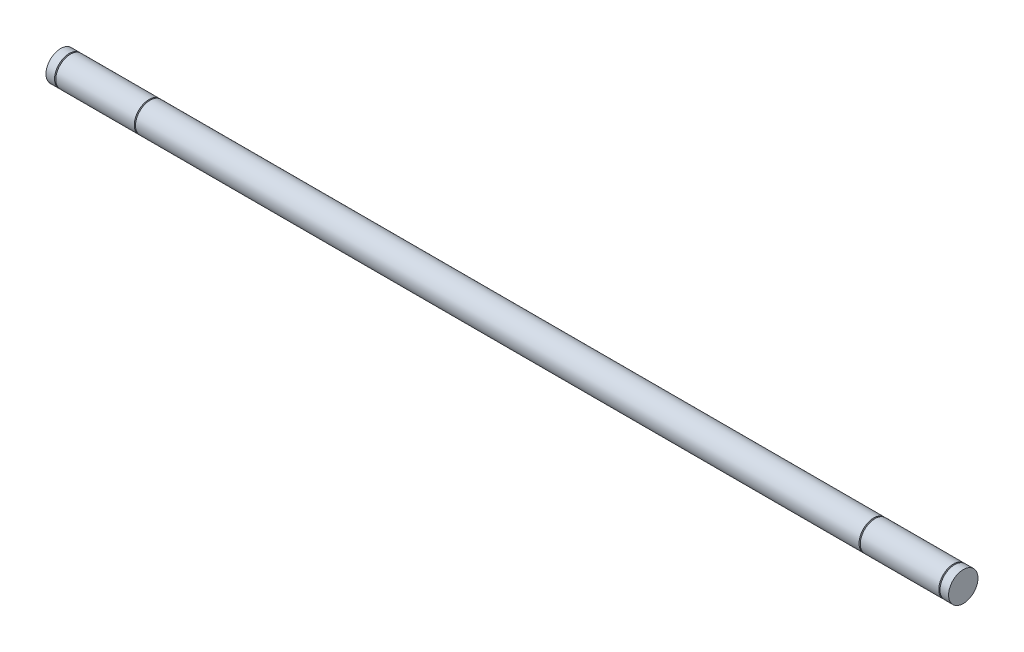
ISO-10303-21;
HEADER;
FILE_DESCRIPTION(('STEP AP214'),'2;1');
FILE_NAME('part.step','',(''),(''),'','','');
FILE_SCHEMA(('AUTOMOTIVE_DESIGN { 1 0 10303 214 1 1 1 1 }'));
ENDSEC;
DATA;
#1=APPLICATION_CONTEXT('core data for automotive mechanical design processes');
#2=APPLICATION_PROTOCOL_DEFINITION('international standard','automotive_design',2000,#1);
#3=PRODUCT_CONTEXT('',#1,'mechanical');
#4=PRODUCT('Part','Part','',(#3));
#5=PRODUCT_RELATED_PRODUCT_CATEGORY('part','',(#4));
#6=PRODUCT_DEFINITION_FORMATION('','',#4);
#7=PRODUCT_DEFINITION_CONTEXT('part definition',#1,'design');
#8=PRODUCT_DEFINITION('design','',#6,#7);
#9=PRODUCT_DEFINITION_SHAPE('','',#8);
#10=(LENGTH_UNIT() NAMED_UNIT(*) SI_UNIT(.MILLI.,.METRE.));
#11=(NAMED_UNIT(*) PLANE_ANGLE_UNIT() SI_UNIT($,.RADIAN.));
#12=(NAMED_UNIT(*) SI_UNIT($,.STERADIAN.) SOLID_ANGLE_UNIT());
#13=UNCERTAINTY_MEASURE_WITH_UNIT(LENGTH_MEASURE(1.E-05),#10,'distance_accuracy_value','');
#14=(GEOMETRIC_REPRESENTATION_CONTEXT(3) GLOBAL_UNCERTAINTY_ASSIGNED_CONTEXT((#13)) GLOBAL_UNIT_ASSIGNED_CONTEXT((#10,
#11,#12)) REPRESENTATION_CONTEXT('',''));
#15=CARTESIAN_POINT('',(0.,0.,0.));
#16=DIRECTION('',(0.,0.,1.));
#17=DIRECTION('',(1.,0.,0.));
#18=AXIS2_PLACEMENT_3D('',#15,#16,#17);
#19=CARTESIAN_POINT('',(292.1,0.,0.));
#20=DIRECTION('',(-1.,0.,0.));
#21=DIRECTION('',(0.,0.,1.));
#22=AXIS2_PLACEMENT_3D('',#19,#20,#21);
#23=CYLINDRICAL_SURFACE('',#22,9.525);
#24=CARTESIAN_POINT('',(-234.15625,0.,0.));
#25=DIRECTION('',(1.,0.,0.));
#26=DIRECTION('',(0.,0.,-1.));
#27=AXIS2_PLACEMENT_3D('',#24,#25,#26);
#28=CIRCLE('',#27,9.525);
#29=CARTESIAN_POINT('',(-234.15625,0.,-9.525));
#30=VERTEX_POINT('',#29);
#31=EDGE_CURVE('E94',#30,#30,#28,.T.);
#32=ORIENTED_EDGE('',*,*,#31,.T.);
#33=EDGE_LOOP('',(#32));
#34=FACE_BOUND('',#33,.T.);
#35=CARTESIAN_POINT('',(234.15625,0.,0.));
#36=DIRECTION('',(1.,0.,0.));
#37=DIRECTION('',(0.,0.,-1.));
#38=AXIS2_PLACEMENT_3D('',#35,#36,#37);
#39=CIRCLE('',#38,9.525);
#40=CARTESIAN_POINT('',(234.15625,0.,-9.525));
#41=VERTEX_POINT('',#40);
#42=EDGE_CURVE('E126',#41,#41,#39,.T.);
#43=ORIENTED_EDGE('',*,*,#42,.F.);
#44=EDGE_LOOP('',(#43));
#45=FACE_BOUND('',#44,.T.);
#46=ADVANCED_FACE('F67',(#34,#45),#23,.T.);
#47=CARTESIAN_POINT('',(-285.75,0.,0.));
#48=DIRECTION('',(1.,0.,0.));
#49=DIRECTION('',(0.,0.,-1.));
#50=AXIS2_PLACEMENT_3D('',#47,#48,#49);
#51=CIRCLE('',#50,9.525);
#52=CARTESIAN_POINT('',(-285.75,0.,-9.525));
#53=VERTEX_POINT('',#52);
#54=EDGE_CURVE('E82',#53,#53,#51,.T.);
#55=ORIENTED_EDGE('',*,*,#54,.T.);
#56=EDGE_LOOP('',(#55));
#57=FACE_BOUND('',#56,.T.);
#58=CARTESIAN_POINT('',(-234.95,0.,0.));
#59=DIRECTION('',(1.,0.,0.));
#60=DIRECTION('',(0.,0.,-1.));
#61=AXIS2_PLACEMENT_3D('',#58,#59,#60);
#62=CIRCLE('',#61,9.525);
#63=CARTESIAN_POINT('',(-234.95,0.,-9.525));
#64=VERTEX_POINT('',#63);
#65=EDGE_CURVE('E98',#64,#64,#62,.T.);
#66=ORIENTED_EDGE('',*,*,#65,.F.);
#67=EDGE_LOOP('',(#66));
#68=FACE_BOUND('',#67,.T.);
#69=ADVANCED_FACE('F158',(#57,#68),#23,.T.);
#70=CARTESIAN_POINT('',(-292.1,0.,0.));
#71=DIRECTION('',(1.,0.,0.));
#72=DIRECTION('',(0.,0.,-1.));
#73=AXIS2_PLACEMENT_3D('',#70,#71,#72);
#74=CIRCLE('',#73,9.525);
#75=CARTESIAN_POINT('',(-292.1,0.,-9.525));
#76=VERTEX_POINT('',#75);
#77=EDGE_CURVE('E71',#76,#76,#74,.T.);
#78=ORIENTED_EDGE('',*,*,#77,.T.);
#79=EDGE_LOOP('',(#78));
#80=FACE_BOUND('',#79,.T.);
#81=CARTESIAN_POINT('',(-286.54375,0.,0.));
#82=DIRECTION('',(1.,0.,0.));
#83=DIRECTION('',(0.,0.,-1.));
#84=AXIS2_PLACEMENT_3D('',#81,#82,#83);
#85=CIRCLE('',#84,9.525);
#86=CARTESIAN_POINT('',(-286.54375,0.,-9.525));
#87=VERTEX_POINT('',#86);
#88=EDGE_CURVE('E80',#87,#87,#85,.T.);
#89=ORIENTED_EDGE('',*,*,#88,.F.);
#90=EDGE_LOOP('',(#89));
#91=FACE_BOUND('',#90,.T.);
#92=ADVANCED_FACE('F165',(#80,#91),#23,.T.);
#93=CARTESIAN_POINT('',(-292.1,0.,0.));
#94=DIRECTION('',(1.,0.,0.));
#95=DIRECTION('',(0.,0.,-1.));
#96=AXIS2_PLACEMENT_3D('',#93,#94,#95);
#97=PLANE('',#96);
#98=ORIENTED_EDGE('',*,*,#77,.F.);
#99=EDGE_LOOP('',(#98));
#100=FACE_BOUND('',#99,.T.);
#101=ADVANCED_FACE('F185',(#100),#97,.F.);
#102=CARTESIAN_POINT('',(-286.54375,0.,0.));
#103=DIRECTION('',(1.,0.,0.));
#104=DIRECTION('',(0.,0.,-1.));
#105=AXIS2_PLACEMENT_3D('',#102,#103,#104);
#106=PLANE('',#105);
#107=CARTESIAN_POINT('',(-286.54375,0.,0.));
#108=DIRECTION('',(1.,0.,0.));
#109=DIRECTION('',(0.,0.,-1.));
#110=AXIS2_PLACEMENT_3D('',#107,#108,#109);
#111=CIRCLE('',#110,7.62);
#112=CARTESIAN_POINT('',(-286.54375,0.,-7.62));
#113=VERTEX_POINT('',#112);
#114=EDGE_CURVE('E86',#113,#113,#111,.T.);
#115=ORIENTED_EDGE('',*,*,#114,.F.);
#116=EDGE_LOOP('',(#115));
#117=FACE_BOUND('',#116,.T.);
#118=ORIENTED_EDGE('',*,*,#88,.T.);
#119=EDGE_LOOP('',(#118));
#120=FACE_BOUND('',#119,.T.);
#121=ADVANCED_FACE('F191',(#117,#120),#106,.T.);
#122=CARTESIAN_POINT('',(-285.75,0.,0.));
#123=DIRECTION('',(1.,0.,0.));
#124=DIRECTION('',(0.,0.,-1.));
#125=AXIS2_PLACEMENT_3D('',#122,#123,#124);
#126=PLANE('',#125);
#127=CARTESIAN_POINT('',(-285.75,0.,0.));
#128=DIRECTION('',(1.,0.,0.));
#129=DIRECTION('',(0.,0.,-1.));
#130=AXIS2_PLACEMENT_3D('',#127,#128,#129);
#131=CIRCLE('',#130,7.62);
#132=CARTESIAN_POINT('',(-285.75,0.,-7.62));
#133=VERTEX_POINT('',#132);
#134=EDGE_CURVE('E90',#133,#133,#131,.T.);
#135=ORIENTED_EDGE('',*,*,#134,.T.);
#136=EDGE_LOOP('',(#135));
#137=FACE_BOUND('',#136,.T.);
#138=ORIENTED_EDGE('',*,*,#54,.F.);
#139=EDGE_LOOP('',(#138));
#140=FACE_BOUND('',#139,.T.);
#141=ADVANCED_FACE('F197',(#137,#140),#126,.F.);
#142=CARTESIAN_POINT('',(-286.54375,0.,0.));
#143=DIRECTION('',(1.,0.,0.));
#144=DIRECTION('',(0.,0.,-1.));
#145=AXIS2_PLACEMENT_3D('',#142,#143,#144);
#146=CYLINDRICAL_SURFACE('',#145,7.62);
#147=ORIENTED_EDGE('',*,*,#114,.T.);
#148=EDGE_LOOP('',(#147));
#149=FACE_BOUND('',#148,.T.);
#150=ORIENTED_EDGE('',*,*,#134,.F.);
#151=EDGE_LOOP('',(#150));
#152=FACE_BOUND('',#151,.T.);
#153=ADVANCED_FACE('F203',(#149,#152),#146,.T.);
#154=CARTESIAN_POINT('',(-234.15625,0.,0.));
#155=DIRECTION('',(1.,0.,0.));
#156=DIRECTION('',(0.,0.,-1.));
#157=AXIS2_PLACEMENT_3D('',#154,#155,#156);
#158=PLANE('',#157);
#159=ORIENTED_EDGE('',*,*,#31,.F.);
#160=EDGE_LOOP('',(#159));
#161=FACE_BOUND('',#160,.T.);
#162=CARTESIAN_POINT('',(-234.15625,0.,0.));
#163=DIRECTION('',(1.,0.,0.));
#164=DIRECTION('',(0.,0.,-1.));
#165=AXIS2_PLACEMENT_3D('',#162,#163,#164);
#166=CIRCLE('',#165,7.9375);
#167=CARTESIAN_POINT('',(-234.15625,0.,-7.9375));
#168=VERTEX_POINT('',#167);
#169=EDGE_CURVE('E102',#168,#168,#166,.T.);
#170=ORIENTED_EDGE('',*,*,#169,.T.);
#171=EDGE_LOOP('',(#170));
#172=FACE_BOUND('',#171,.T.);
#173=ADVANCED_FACE('F210',(#161,#172),#158,.F.);
#174=CARTESIAN_POINT('',(-234.95,0.,0.));
#175=DIRECTION('',(1.,0.,0.));
#176=DIRECTION('',(0.,0.,-1.));
#177=AXIS2_PLACEMENT_3D('',#174,#175,#176);
#178=PLANE('',#177);
#179=ORIENTED_EDGE('',*,*,#65,.T.);
#180=EDGE_LOOP('',(#179));
#181=FACE_BOUND('',#180,.T.);
#182=CARTESIAN_POINT('',(-234.95,0.,0.));
#183=DIRECTION('',(1.,0.,0.));
#184=DIRECTION('',(0.,0.,-1.));
#185=AXIS2_PLACEMENT_3D('',#182,#183,#184);
#186=CIRCLE('',#185,7.9375);
#187=CARTESIAN_POINT('',(-234.95,0.,-7.9375));
#188=VERTEX_POINT('',#187);
#189=EDGE_CURVE('E106',#188,#188,#186,.T.);
#190=ORIENTED_EDGE('',*,*,#189,.F.);
#191=EDGE_LOOP('',(#190));
#192=FACE_BOUND('',#191,.T.);
#193=ADVANCED_FACE('F212',(#181,#192),#178,.T.);
#194=CARTESIAN_POINT('',(-234.15625,0.,0.));
#195=DIRECTION('',(-1.,0.,0.));
#196=DIRECTION('',(0.,0.,1.));
#197=AXIS2_PLACEMENT_3D('',#194,#195,#196);
#198=CYLINDRICAL_SURFACE('',#197,7.9375);
#199=ORIENTED_EDGE('',*,*,#169,.F.);
#200=EDGE_LOOP('',(#199));
#201=FACE_BOUND('',#200,.T.);
#202=ORIENTED_EDGE('',*,*,#189,.T.);
#203=EDGE_LOOP('',(#202));
#204=FACE_BOUND('',#203,.T.);
#205=ADVANCED_FACE('F153',(#201,#204),#198,.T.);
#206=CARTESIAN_POINT('',(234.15625,0.,0.));
#207=DIRECTION('',(1.,0.,0.));
#208=DIRECTION('',(0.,0.,-1.));
#209=AXIS2_PLACEMENT_3D('',#206,#207,#208);
#210=PLANE('',#209);
#211=CARTESIAN_POINT('',(234.15625,0.,0.));
#212=DIRECTION('',(1.,0.,0.));
#213=DIRECTION('',(0.,0.,-1.));
#214=AXIS2_PLACEMENT_3D('',#211,#212,#213);
#215=CIRCLE('',#214,7.9375);
#216=CARTESIAN_POINT('',(234.15625,0.,-7.9375));
#217=VERTEX_POINT('',#216);
#218=EDGE_CURVE('E134',#217,#217,#215,.T.);
#219=ORIENTED_EDGE('',*,*,#218,.F.);
#220=EDGE_LOOP('',(#219));
#221=FACE_BOUND('',#220,.T.);
#222=ORIENTED_EDGE('',*,*,#42,.T.);
#223=EDGE_LOOP('',(#222));
#224=FACE_BOUND('',#223,.T.);
#225=ADVANCED_FACE('F149',(#221,#224),#210,.T.);
#226=CARTESIAN_POINT('',(234.95,0.,0.));
#227=DIRECTION('',(1.,0.,0.));
#228=DIRECTION('',(0.,0.,-1.));
#229=AXIS2_PLACEMENT_3D('',#226,#227,#228);
#230=PLANE('',#229);
#231=CARTESIAN_POINT('',(234.95,0.,0.));
#232=DIRECTION('',(1.,0.,0.));
#233=DIRECTION('',(0.,0.,-1.));
#234=AXIS2_PLACEMENT_3D('',#231,#232,#233);
#235=CIRCLE('',#234,7.9375);
#236=CARTESIAN_POINT('',(234.95,0.,-7.9375));
#237=VERTEX_POINT('',#236);
#238=EDGE_CURVE('E138',#237,#237,#235,.T.);
#239=ORIENTED_EDGE('',*,*,#238,.T.);
#240=EDGE_LOOP('',(#239));
#241=FACE_BOUND('',#240,.T.);
#242=CARTESIAN_POINT('',(234.95,0.,0.));
#243=DIRECTION('',(1.,0.,0.));
#244=DIRECTION('',(0.,0.,-1.));
#245=AXIS2_PLACEMENT_3D('',#242,#243,#244);
#246=CIRCLE('',#245,9.525);
#247=CARTESIAN_POINT('',(234.95,0.,-9.525));
#248=VERTEX_POINT('',#247);
#249=EDGE_CURVE('E130',#248,#248,#246,.T.);
#250=ORIENTED_EDGE('',*,*,#249,.F.);
#251=EDGE_LOOP('',(#250));
#252=FACE_BOUND('',#251,.T.);
#253=ADVANCED_FACE('F152',(#241,#252),#230,.F.);
#254=CARTESIAN_POINT('',(234.15625,0.,0.));
#255=DIRECTION('',(1.,0.,0.));
#256=DIRECTION('',(0.,0.,-1.));
#257=AXIS2_PLACEMENT_3D('',#254,#255,#256);
#258=CYLINDRICAL_SURFACE('',#257,7.9375);
#259=ORIENTED_EDGE('',*,*,#218,.T.);
#260=EDGE_LOOP('',(#259));
#261=FACE_BOUND('',#260,.T.);
#262=ORIENTED_EDGE('',*,*,#238,.F.);
#263=EDGE_LOOP('',(#262));
#264=FACE_BOUND('',#263,.T.);
#265=ADVANCED_FACE('F146',(#261,#264),#258,.T.);
#266=CARTESIAN_POINT('',(292.1,0.,0.));
#267=DIRECTION('',(1.,0.,0.));
#268=DIRECTION('',(0.,0.,-1.));
#269=AXIS2_PLACEMENT_3D('',#266,#267,#268);
#270=PLANE('',#269);
#271=CARTESIAN_POINT('',(292.1,0.,0.));
#272=DIRECTION('',(1.,0.,0.));
#273=DIRECTION('',(0.,0.,-1.));
#274=AXIS2_PLACEMENT_3D('',#271,#272,#273);
#275=CIRCLE('',#274,9.525);
#276=CARTESIAN_POINT('',(292.1,0.,-9.525));
#277=VERTEX_POINT('',#276);
#278=EDGE_CURVE('E11',#277,#277,#275,.T.);
#279=ORIENTED_EDGE('',*,*,#278,.T.);
#280=EDGE_LOOP('',(#279));
#281=FACE_BOUND('',#280,.T.);
#282=ADVANCED_FACE('F172',(#281),#270,.T.);
#283=CARTESIAN_POINT('',(286.54375,0.,0.));
#284=DIRECTION('',(1.,0.,0.));
#285=DIRECTION('',(0.,0.,-1.));
#286=AXIS2_PLACEMENT_3D('',#283,#284,#285);
#287=CIRCLE('',#286,9.525);
#288=CARTESIAN_POINT('',(286.54375,0.,-9.525));
#289=VERTEX_POINT('',#288);
#290=EDGE_CURVE('E110',#289,#289,#287,.T.);
#291=ORIENTED_EDGE('',*,*,#290,.T.);
#292=EDGE_LOOP('',(#291));
#293=FACE_BOUND('',#292,.T.);
#294=ORIENTED_EDGE('',*,*,#278,.F.);
#295=EDGE_LOOP('',(#294));
#296=FACE_BOUND('',#295,.T.);
#297=ADVANCED_FACE('F69',(#293,#296),#23,.T.);
#298=CARTESIAN_POINT('',(286.54375,0.,0.));
#299=DIRECTION('',(1.,0.,0.));
#300=DIRECTION('',(0.,0.,-1.));
#301=AXIS2_PLACEMENT_3D('',#298,#299,#300);
#302=PLANE('',#301);
#303=ORIENTED_EDGE('',*,*,#290,.F.);
#304=EDGE_LOOP('',(#303));
#305=FACE_BOUND('',#304,.T.);
#306=CARTESIAN_POINT('',(286.54375,0.,0.));
#307=DIRECTION('',(1.,0.,0.));
#308=DIRECTION('',(0.,0.,-1.));
#309=AXIS2_PLACEMENT_3D('',#306,#307,#308);
#310=CIRCLE('',#309,7.62);
#311=CARTESIAN_POINT('',(286.54375,0.,-7.62));
#312=VERTEX_POINT('',#311);
#313=EDGE_CURVE('E118',#312,#312,#310,.T.);
#314=ORIENTED_EDGE('',*,*,#313,.T.);
#315=EDGE_LOOP('',(#314));
#316=FACE_BOUND('',#315,.T.);
#317=ADVANCED_FACE('F171',(#305,#316),#302,.F.);
#318=CARTESIAN_POINT('',(286.54375,0.,0.));
#319=DIRECTION('',(-1.,0.,0.));
#320=DIRECTION('',(0.,0.,1.));
#321=AXIS2_PLACEMENT_3D('',#318,#319,#320);
#322=CYLINDRICAL_SURFACE('',#321,7.62);
#323=ORIENTED_EDGE('',*,*,#313,.F.);
#324=EDGE_LOOP('',(#323));
#325=FACE_BOUND('',#324,.T.);
#326=CARTESIAN_POINT('',(285.75,0.,0.));
#327=DIRECTION('',(1.,0.,0.));
#328=DIRECTION('',(0.,0.,-1.));
#329=AXIS2_PLACEMENT_3D('',#326,#327,#328);
#330=CIRCLE('',#329,7.62);
#331=CARTESIAN_POINT('',(285.75,0.,-7.62));
#332=VERTEX_POINT('',#331);
#333=EDGE_CURVE('E122',#332,#332,#330,.T.);
#334=ORIENTED_EDGE('',*,*,#333,.T.);
#335=EDGE_LOOP('',(#334));
#336=FACE_BOUND('',#335,.T.);
#337=ADVANCED_FACE('F178',(#325,#336),#322,.T.);
#338=CARTESIAN_POINT('',(285.75,0.,0.));
#339=DIRECTION('',(1.,0.,0.));
#340=DIRECTION('',(0.,0.,-1.));
#341=AXIS2_PLACEMENT_3D('',#338,#339,#340);
#342=PLANE('',#341);
#343=CARTESIAN_POINT('',(285.75,0.,0.));
#344=DIRECTION('',(1.,0.,0.));
#345=DIRECTION('',(0.,0.,-1.));
#346=AXIS2_PLACEMENT_3D('',#343,#344,#345);
#347=CIRCLE('',#346,9.525);
#348=CARTESIAN_POINT('',(285.75,0.,-9.525));
#349=VERTEX_POINT('',#348);
#350=EDGE_CURVE('E114',#349,#349,#347,.T.);
#351=ORIENTED_EDGE('',*,*,#350,.T.);
#352=EDGE_LOOP('',(#351));
#353=FACE_BOUND('',#352,.T.);
#354=ORIENTED_EDGE('',*,*,#333,.F.);
#355=EDGE_LOOP('',(#354));
#356=FACE_BOUND('',#355,.T.);
#357=ADVANCED_FACE('F168',(#353,#356),#342,.T.);
#358=ORIENTED_EDGE('',*,*,#249,.T.);
#359=EDGE_LOOP('',(#358));
#360=FACE_BOUND('',#359,.T.);
#361=ORIENTED_EDGE('',*,*,#350,.F.);
#362=EDGE_LOOP('',(#361));
#363=FACE_BOUND('',#362,.T.);
#364=ADVANCED_FACE('F160',(#360,#363),#23,.T.);
#365=CLOSED_SHELL('',(#46,#69,#92,#101,#121,#141,#153,#173,#193,#205,#225,#253,#265,#282,#297,
#317,#337,#357,#364));
#366=MANIFOLD_SOLID_BREP('B2',#365);
#367=ADVANCED_BREP_SHAPE_REPRESENTATION('',(#18,#366),#14);
#368=SHAPE_DEFINITION_REPRESENTATION(#9,#367);
ENDSEC;
END-ISO-10303-21;
